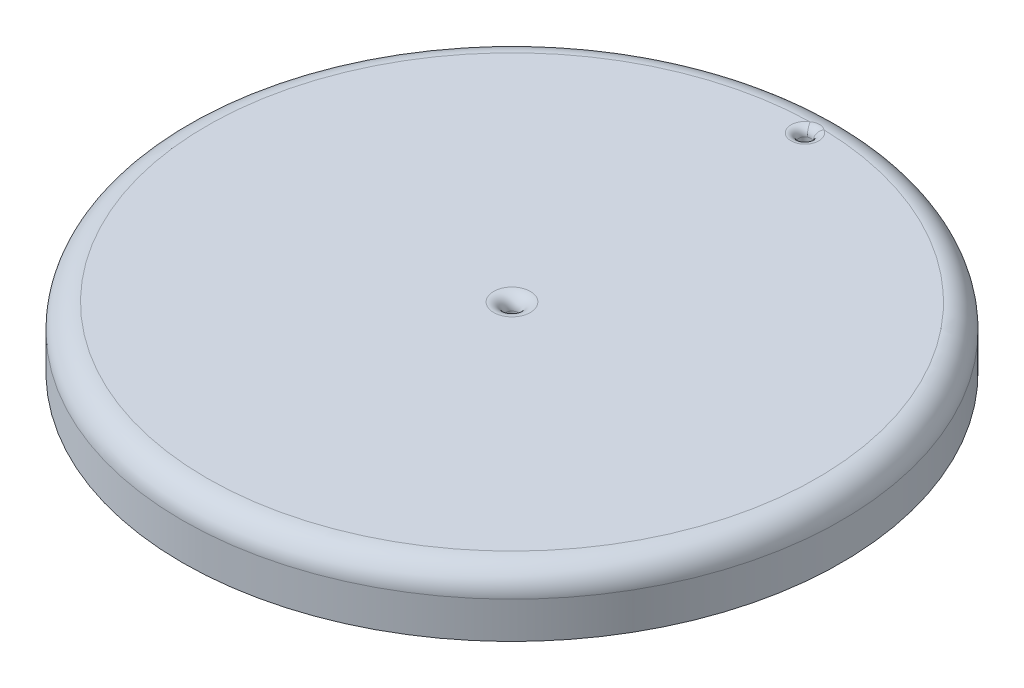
from build123d import *

# Parameters (mm, degrees)
SKETCH3_R          = 85.725
SKETCH3_R_2        = 1.5875
BASE_EXTRUDE_DEPTH = 15.875
FILLET2_R          = 6.35
FILLET3_R          = 3.175
FILLET4_R          = 2.032


with BuildPart() as part:
    # Sketch3 → Base-Extrude (new body)
    with BuildSketch(Plane(origin=(0, 0, 0), x_dir=(1, 0, 0), z_dir=(0, 1, 0))):
        with Locations(Location((0, 0, 0), (0, 0, 270))):
            Circle(SKETCH3_R)
        with Locations(Location((0, 0, 0), (0, 0, 270))):
            Circle(SKETCH3_R_2, mode=Mode.SUBTRACT)
        with Locations(Location((0, 76.2, 0), (0, 0, 270))):
            Circle(SKETCH3_R_2, mode=Mode.SUBTRACT)
    extrude(amount=BASE_EXTRUDE_DEPTH)

    # Fillet2
    fillet2_edges = [part.edges().sort_by_distance(p)[0] for p in [
        (0, 15.875, -85.725),
    ]]
    fillet(fillet2_edges, radius=FILLET2_R)

    # Fillet3
    fillet3_edges = [part.edges().sort_by_distance(p)[0] for p in [
        (0, 15.875, -1.5875),
    ]]
    fillet(fillet3_edges, radius=FILLET3_R)

    # Fillet4
    fillet4_edges = [part.edges().sort_by_distance(p)[0] for p in [
        (0, 15.875, -77.7875),
    ]]
    fillet(fillet4_edges, radius=FILLET4_R)


solid = part.part
